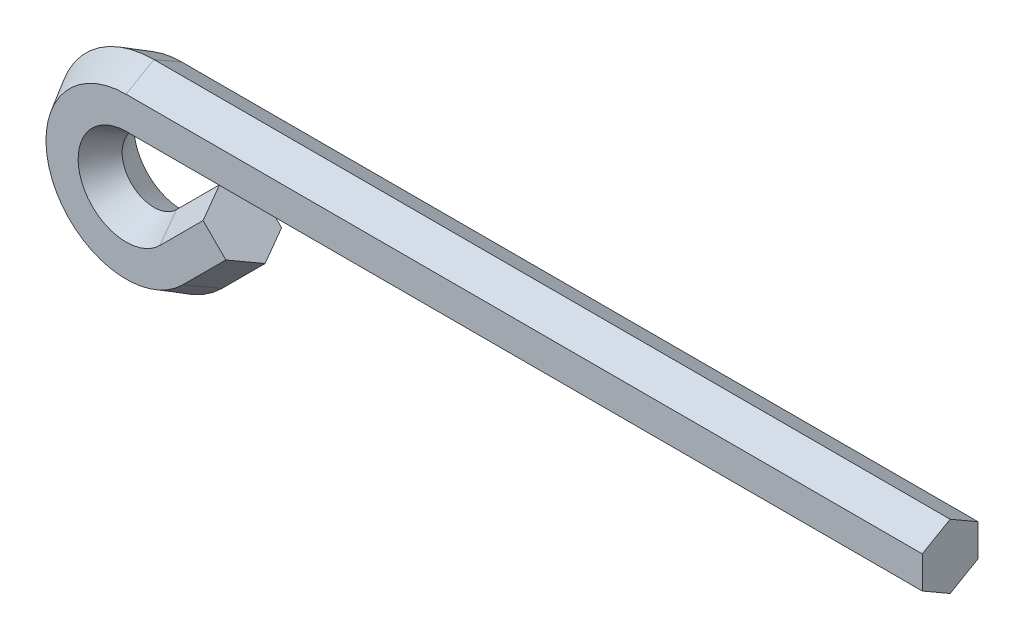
ISO-10303-21;
HEADER;
FILE_DESCRIPTION(('STEP AP214'),'2;1');
FILE_NAME('part.step','',(''),(''),'','','');
FILE_SCHEMA(('AUTOMOTIVE_DESIGN { 1 0 10303 214 1 1 1 1 }'));
ENDSEC;
DATA;
#1=APPLICATION_CONTEXT('core data for automotive mechanical design processes');
#2=APPLICATION_PROTOCOL_DEFINITION('international standard','automotive_design',2000,#1);
#3=PRODUCT_CONTEXT('',#1,'mechanical');
#4=PRODUCT('Part','Part','',(#3));
#5=PRODUCT_RELATED_PRODUCT_CATEGORY('part','',(#4));
#6=PRODUCT_DEFINITION_FORMATION('','',#4);
#7=PRODUCT_DEFINITION_CONTEXT('part definition',#1,'design');
#8=PRODUCT_DEFINITION('design','',#6,#7);
#9=PRODUCT_DEFINITION_SHAPE('','',#8);
#10=(LENGTH_UNIT() NAMED_UNIT(*) SI_UNIT(.MILLI.,.METRE.));
#11=(NAMED_UNIT(*) PLANE_ANGLE_UNIT() SI_UNIT($,.RADIAN.));
#12=(NAMED_UNIT(*) SI_UNIT($,.STERADIAN.) SOLID_ANGLE_UNIT());
#13=UNCERTAINTY_MEASURE_WITH_UNIT(LENGTH_MEASURE(1.E-05),#10,'distance_accuracy_value','');
#14=(GEOMETRIC_REPRESENTATION_CONTEXT(3) GLOBAL_UNCERTAINTY_ASSIGNED_CONTEXT((#13)) GLOBAL_UNIT_ASSIGNED_CONTEXT((#10,
#11,#12)) REPRESENTATION_CONTEXT('',''));
#15=CARTESIAN_POINT('',(0.,0.,0.));
#16=DIRECTION('',(0.,0.,1.));
#17=DIRECTION('',(1.,0.,0.));
#18=AXIS2_PLACEMENT_3D('',#15,#16,#17);
#19=CARTESIAN_POINT('',(7.11503417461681,-7.11503417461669,-3.5));
#20=DIRECTION('',(-0.612372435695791,0.612372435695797,0.500000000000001));
#21=DIRECTION('',(-0.707106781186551,-0.707106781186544,0.));
#22=AXIS2_PLACEMENT_3D('',#19,#20,#21);
#23=PLANE('',#22);
#24=DIRECTION('',(0.353553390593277,-0.353553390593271,0.866025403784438));
#25=VECTOR('',#24,1.);
#26=CARTESIAN_POINT('',(7.11503417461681,-7.11503417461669,-3.5));
#27=LINE('',#26,#25);
#28=CARTESIAN_POINT('',(7.11503417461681,-7.11503417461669,-3.5));
#29=VERTEX_POINT('',#28);
#30=CARTESIAN_POINT('',(8.54390319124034,-8.5439031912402,0.));
#31=VERTEX_POINT('',#30);
#32=EDGE_CURVE('E133',#29,#31,#27,.T.);
#33=ORIENTED_EDGE('',*,*,#32,.F.);
#34=DIRECTION('',(0.707106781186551,0.707106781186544,0.));
#35=VECTOR('',#34,1.);
#36=CARTESIAN_POINT('',(7.11503417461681,-7.11503417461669,-3.5));
#37=LINE('',#36,#35);
#38=CARTESIAN_POINT('',(12.52924773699,-1.70082061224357,-3.5));
#39=VERTEX_POINT('',#38);
#40=EDGE_CURVE('E42',#29,#39,#37,.T.);
#41=ORIENTED_EDGE('',*,*,#40,.T.);
#42=DIRECTION('',(0.353553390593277,-0.353553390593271,0.866025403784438));
#43=VECTOR('',#42,1.);
#44=CARTESIAN_POINT('',(12.52924773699,-1.70082061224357,-3.5));
#45=LINE('',#44,#43);
#46=CARTESIAN_POINT('',(13.9581167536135,-3.12968962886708,0.));
#47=VERTEX_POINT('',#46);
#48=EDGE_CURVE('E49',#39,#47,#45,.T.);
#49=ORIENTED_EDGE('',*,*,#48,.T.);
#50=DIRECTION('',(0.707106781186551,0.707106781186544,0.));
#51=VECTOR('',#50,1.);
#52=CARTESIAN_POINT('',(8.54390319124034,-8.5439031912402,0.));
#53=LINE('',#52,#51);
#54=EDGE_CURVE('E11',#31,#47,#53,.T.);
#55=ORIENTED_EDGE('',*,*,#54,.F.);
#56=EDGE_LOOP('',(#33,#41,#49,#55));
#57=FACE_BOUND('',#56,.T.);
#58=ADVANCED_FACE('F34',(#57),#23,.F.);
#59=CARTESIAN_POINT('',(2.82842712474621,-2.82842712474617,0.));
#60=DIRECTION('',(0.612372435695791,-0.612372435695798,0.5));
#61=DIRECTION('',(0.707106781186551,0.707106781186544,0.));
#62=AXIS2_PLACEMENT_3D('',#59,#60,#61);
#63=PLANE('',#62);
#64=DIRECTION('',(0.353553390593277,-0.353553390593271,-0.866025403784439));
#65=VECTOR('',#64,1.);
#66=CARTESIAN_POINT('',(2.82842712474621,-2.82842712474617,0.));
#67=LINE('',#66,#65);
#68=CARTESIAN_POINT('',(2.82842712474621,-2.82842712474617,0.));
#69=VERTEX_POINT('',#68);
#70=CARTESIAN_POINT('',(4.25729614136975,-4.25729614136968,-3.5));
#71=VERTEX_POINT('',#70);
#72=EDGE_CURVE('E212',#69,#71,#67,.T.);
#73=ORIENTED_EDGE('',*,*,#72,.F.);
#74=DIRECTION('',(0.707106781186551,0.707106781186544,0.));
#75=VECTOR('',#74,1.);
#76=CARTESIAN_POINT('',(2.82842712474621,-2.82842712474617,0.));
#77=LINE('',#76,#75);
#78=CARTESIAN_POINT('',(8.24264068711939,2.58578643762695,0.));
#79=VERTEX_POINT('',#78);
#80=EDGE_CURVE('E256',#69,#79,#77,.T.);
#81=ORIENTED_EDGE('',*,*,#80,.T.);
#82=DIRECTION('',(0.353553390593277,-0.353553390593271,-0.866025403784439));
#83=VECTOR('',#82,1.);
#84=CARTESIAN_POINT('',(8.24264068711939,2.58578643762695,0.));
#85=LINE('',#84,#83);
#86=CARTESIAN_POINT('',(9.67150970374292,1.15691742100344,-3.5));
#87=VERTEX_POINT('',#86);
#88=EDGE_CURVE('E243',#79,#87,#85,.T.);
#89=ORIENTED_EDGE('',*,*,#88,.T.);
#90=DIRECTION('',(0.707106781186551,0.707106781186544,0.));
#91=VECTOR('',#90,1.);
#92=CARTESIAN_POINT('',(4.25729614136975,-4.25729614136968,-3.5));
#93=LINE('',#92,#91);
#94=EDGE_CURVE('E260',#71,#87,#93,.T.);
#95=ORIENTED_EDGE('',*,*,#94,.F.);
#96=EDGE_LOOP('',(#73,#81,#89,#95));
#97=FACE_BOUND('',#96,.T.);
#98=ADVANCED_FACE('F282',(#97),#63,.F.);
#99=CARTESIAN_POINT('',(2.82842712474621,-2.82842712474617,0.));
#100=DIRECTION('',(-0.612372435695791,0.612372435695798,0.5));
#101=DIRECTION('',(-0.707106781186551,-0.707106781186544,0.));
#102=AXIS2_PLACEMENT_3D('',#99,#100,#101);
#103=PLANE('',#102);
#104=DIRECTION('',(0.353553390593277,-0.353553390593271,0.866025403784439));
#105=VECTOR('',#104,1.);
#106=CARTESIAN_POINT('',(2.82842712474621,-2.82842712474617,0.));
#107=LINE('',#106,#105);
#108=CARTESIAN_POINT('',(4.25729614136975,-4.25729614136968,3.5));
#109=VERTEX_POINT('',#108);
#110=EDGE_CURVE('E209',#69,#109,#107,.T.);
#111=ORIENTED_EDGE('',*,*,#110,.T.);
#112=DIRECTION('',(0.707106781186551,0.707106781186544,0.));
#113=VECTOR('',#112,1.);
#114=CARTESIAN_POINT('',(4.25729614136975,-4.25729614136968,3.5));
#115=LINE('',#114,#113);
#116=CARTESIAN_POINT('',(9.67150970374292,1.15691742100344,3.5));
#117=VERTEX_POINT('',#116);
#118=EDGE_CURVE('E252',#109,#117,#115,.T.);
#119=ORIENTED_EDGE('',*,*,#118,.T.);
#120=DIRECTION('',(0.353553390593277,-0.353553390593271,0.866025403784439));
#121=VECTOR('',#120,1.);
#122=CARTESIAN_POINT('',(8.24264068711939,2.58578643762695,0.));
#123=LINE('',#122,#121);
#124=EDGE_CURVE('E240',#79,#117,#123,.T.);
#125=ORIENTED_EDGE('',*,*,#124,.F.);
#126=ORIENTED_EDGE('',*,*,#80,.F.);
#127=EDGE_LOOP('',(#111,#119,#125,#126));
#128=FACE_BOUND('',#127,.T.);
#129=ADVANCED_FACE('F286',(#128),#103,.T.);
#130=CARTESIAN_POINT('',(7.11503417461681,-7.11503417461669,3.5));
#131=DIRECTION('',(0.612372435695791,-0.612372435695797,0.500000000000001));
#132=DIRECTION('',(0.707106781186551,0.707106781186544,0.));
#133=AXIS2_PLACEMENT_3D('',#130,#131,#132);
#134=PLANE('',#133);
#135=DIRECTION('',(0.353553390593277,-0.353553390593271,-0.866025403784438));
#136=VECTOR('',#135,1.);
#137=CARTESIAN_POINT('',(7.11503417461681,-7.11503417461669,3.5));
#138=LINE('',#137,#136);
#139=CARTESIAN_POINT('',(7.11503417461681,-7.11503417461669,3.5));
#140=VERTEX_POINT('',#139);
#141=EDGE_CURVE('E160',#140,#31,#138,.T.);
#142=ORIENTED_EDGE('',*,*,#141,.T.);
#143=ORIENTED_EDGE('',*,*,#54,.T.);
#144=DIRECTION('',(0.353553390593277,-0.353553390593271,-0.866025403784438));
#145=VECTOR('',#144,1.);
#146=CARTESIAN_POINT('',(12.52924773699,-1.70082061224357,3.5));
#147=LINE('',#146,#145);
#148=CARTESIAN_POINT('',(12.52924773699,-1.70082061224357,3.5));
#149=VERTEX_POINT('',#148);
#150=EDGE_CURVE('E137',#149,#47,#147,.T.);
#151=ORIENTED_EDGE('',*,*,#150,.F.);
#152=DIRECTION('',(0.707106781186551,0.707106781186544,0.));
#153=VECTOR('',#152,1.);
#154=CARTESIAN_POINT('',(7.11503417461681,-7.11503417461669,3.5));
#155=LINE('',#154,#153);
#156=EDGE_CURVE('E249',#140,#149,#155,.T.);
#157=ORIENTED_EDGE('',*,*,#156,.F.);
#158=EDGE_LOOP('',(#142,#143,#151,#157));
#159=FACE_BOUND('',#158,.T.);
#160=ADVANCED_FACE('F291',(#159),#134,.T.);
#161=CARTESIAN_POINT('',(0.,0.,-3.5));
#162=DIRECTION('',(0.,0.,1.));
#163=DIRECTION('',(1.,0.,0.));
#164=AXIS2_PLACEMENT_3D('',#161,#162,#163);
#165=CONICAL_SURFACE('',#164,10.0621778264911,0.523598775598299);
#166=DIRECTION('',(0.,0.500000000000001,0.866025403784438));
#167=VECTOR('',#166,1.);
#168=CARTESIAN_POINT('',(0.,10.0621778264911,-3.5));
#169=LINE('',#168,#167);
#170=CARTESIAN_POINT('',(0.,10.0621778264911,-3.5));
#171=VERTEX_POINT('',#170);
#172=CARTESIAN_POINT('',(0.,12.0829037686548,0.));
#173=VERTEX_POINT('',#172);
#174=EDGE_CURVE('E130',#171,#173,#169,.T.);
#175=ORIENTED_EDGE('',*,*,#174,.F.);
#176=CARTESIAN_POINT('',(0.,0.,-3.5));
#177=DIRECTION('',(0.,0.,1.));
#178=DIRECTION('',(1.,0.,0.));
#179=AXIS2_PLACEMENT_3D('',#176,#177,#178);
#180=CIRCLE('',#179,10.0621778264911);
#181=EDGE_CURVE('E138',#171,#29,#180,.T.);
#182=ORIENTED_EDGE('',*,*,#181,.T.);
#183=ORIENTED_EDGE('',*,*,#32,.T.);
#184=CARTESIAN_POINT('',(0.,0.,0.));
#185=DIRECTION('',(0.,0.,1.));
#186=DIRECTION('',(1.,0.,0.));
#187=AXIS2_PLACEMENT_3D('',#184,#185,#186);
#188=CIRCLE('',#187,12.0829037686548);
#189=EDGE_CURVE('E125',#173,#31,#188,.T.);
#190=ORIENTED_EDGE('',*,*,#189,.F.);
#191=EDGE_LOOP('',(#175,#182,#183,#190));
#192=FACE_BOUND('',#191,.T.);
#193=ADVANCED_FACE('F127',(#192),#165,.T.);
#194=CARTESIAN_POINT('',(0.,0.,0.));
#195=DIRECTION('',(0.,0.,-1.));
#196=DIRECTION('',(-1.,0.,0.));
#197=AXIS2_PLACEMENT_3D('',#194,#195,#196);
#198=CONICAL_SURFACE('',#197,4.,0.523598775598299);
#199=DIRECTION('',(0.,0.5,-0.866025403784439));
#200=VECTOR('',#199,1.);
#201=CARTESIAN_POINT('',(0.,4.,0.));
#202=LINE('',#201,#200);
#203=CARTESIAN_POINT('',(0.,4.,0.));
#204=VERTEX_POINT('',#203);
#205=CARTESIAN_POINT('',(0.,6.02072594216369,-3.5));
#206=VERTEX_POINT('',#205);
#207=EDGE_CURVE('E165',#204,#206,#202,.T.);
#208=ORIENTED_EDGE('',*,*,#207,.F.);
#209=CARTESIAN_POINT('',(0.,0.,0.));
#210=DIRECTION('',(0.,0.,1.));
#211=DIRECTION('',(1.,0.,0.));
#212=AXIS2_PLACEMENT_3D('',#209,#210,#211);
#213=CIRCLE('',#212,4.);
#214=EDGE_CURVE('E224',#204,#69,#213,.T.);
#215=ORIENTED_EDGE('',*,*,#214,.T.);
#216=ORIENTED_EDGE('',*,*,#72,.T.);
#217=CARTESIAN_POINT('',(0.,0.,-3.5));
#218=DIRECTION('',(0.,0.,1.));
#219=DIRECTION('',(1.,0.,0.));
#220=AXIS2_PLACEMENT_3D('',#217,#218,#219);
#221=CIRCLE('',#220,6.02072594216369);
#222=EDGE_CURVE('E228',#206,#71,#221,.T.);
#223=ORIENTED_EDGE('',*,*,#222,.F.);
#224=EDGE_LOOP('',(#208,#215,#216,#223));
#225=FACE_BOUND('',#224,.T.);
#226=ADVANCED_FACE('F278',(#225),#198,.F.);
#227=CARTESIAN_POINT('',(0.,0.,0.));
#228=DIRECTION('',(0.,0.,1.));
#229=DIRECTION('',(1.,0.,0.));
#230=AXIS2_PLACEMENT_3D('',#227,#228,#229);
#231=CONICAL_SURFACE('',#230,4.,0.523598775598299);
#232=DIRECTION('',(0.,0.5,0.866025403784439));
#233=VECTOR('',#232,1.);
#234=CARTESIAN_POINT('',(0.,4.,0.));
#235=LINE('',#234,#233);
#236=CARTESIAN_POINT('',(0.,6.02072594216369,3.5));
#237=VERTEX_POINT('',#236);
#238=EDGE_CURVE('E172',#204,#237,#235,.T.);
#239=ORIENTED_EDGE('',*,*,#238,.T.);
#240=CARTESIAN_POINT('',(0.,0.,3.5));
#241=DIRECTION('',(0.,0.,1.));
#242=DIRECTION('',(1.,0.,0.));
#243=AXIS2_PLACEMENT_3D('',#240,#241,#242);
#244=CIRCLE('',#243,6.02072594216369);
#245=EDGE_CURVE('E220',#237,#109,#244,.T.);
#246=ORIENTED_EDGE('',*,*,#245,.T.);
#247=ORIENTED_EDGE('',*,*,#110,.F.);
#248=ORIENTED_EDGE('',*,*,#214,.F.);
#249=EDGE_LOOP('',(#239,#246,#247,#248));
#250=FACE_BOUND('',#249,.T.);
#251=ADVANCED_FACE('F284',(#250),#231,.F.);
#252=CARTESIAN_POINT('',(0.,0.,3.5));
#253=DIRECTION('',(0.,0.,-1.));
#254=DIRECTION('',(-1.,0.,0.));
#255=AXIS2_PLACEMENT_3D('',#252,#253,#254);
#256=CONICAL_SURFACE('',#255,10.0621778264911,0.523598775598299);
#257=DIRECTION('',(0.,0.500000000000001,-0.866025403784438));
#258=VECTOR('',#257,1.);
#259=CARTESIAN_POINT('',(0.,10.0621778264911,3.5));
#260=LINE('',#259,#258);
#261=CARTESIAN_POINT('',(0.,10.0621778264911,3.5));
#262=VERTEX_POINT('',#261);
#263=EDGE_CURVE('E141',#262,#173,#260,.T.);
#264=ORIENTED_EDGE('',*,*,#263,.T.);
#265=ORIENTED_EDGE('',*,*,#189,.T.);
#266=ORIENTED_EDGE('',*,*,#141,.F.);
#267=CARTESIAN_POINT('',(0.,0.,3.5));
#268=DIRECTION('',(0.,0.,1.));
#269=DIRECTION('',(1.,0.,0.));
#270=AXIS2_PLACEMENT_3D('',#267,#268,#269);
#271=CIRCLE('',#270,10.0621778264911);
#272=EDGE_CURVE('E145',#262,#140,#271,.T.);
#273=ORIENTED_EDGE('',*,*,#272,.F.);
#274=EDGE_LOOP('',(#264,#265,#266,#273));
#275=FACE_BOUND('',#274,.T.);
#276=ADVANCED_FACE('F143',(#275),#256,.T.);
#277=CARTESIAN_POINT('',(0.,10.0621778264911,3.5));
#278=DIRECTION('',(0.,-0.866025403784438,-0.500000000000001));
#279=DIRECTION('',(0.,0.500000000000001,-0.866025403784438));
#280=AXIS2_PLACEMENT_3D('',#277,#278,#279);
#281=PLANE('',#280);
#282=DIRECTION('',(0.,0.500000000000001,-0.866025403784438));
#283=VECTOR('',#282,1.);
#284=CARTESIAN_POINT('',(100.,10.0621778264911,3.5));
#285=LINE('',#284,#283);
#286=CARTESIAN_POINT('',(100.,10.0621778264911,3.5));
#287=VERTEX_POINT('',#286);
#288=CARTESIAN_POINT('',(100.,12.0829037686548,0.));
#289=VERTEX_POINT('',#288);
#290=EDGE_CURVE('E155',#287,#289,#285,.T.);
#291=ORIENTED_EDGE('',*,*,#290,.T.);
#292=DIRECTION('',(1.,0.,0.));
#293=VECTOR('',#292,1.);
#294=CARTESIAN_POINT('',(0.,12.0829037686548,0.));
#295=LINE('',#294,#293);
#296=EDGE_CURVE('E152',#173,#289,#295,.T.);
#297=ORIENTED_EDGE('',*,*,#296,.F.);
#298=ORIENTED_EDGE('',*,*,#263,.F.);
#299=DIRECTION('',(1.,0.,0.));
#300=VECTOR('',#299,1.);
#301=CARTESIAN_POINT('',(0.,10.0621778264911,3.5));
#302=LINE('',#301,#300);
#303=EDGE_CURVE('E178',#262,#287,#302,.T.);
#304=ORIENTED_EDGE('',*,*,#303,.T.);
#305=EDGE_LOOP('',(#291,#297,#298,#304));
#306=FACE_BOUND('',#305,.T.);
#307=ADVANCED_FACE('F153',(#306),#281,.F.);
#308=CARTESIAN_POINT('',(0.,10.0621778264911,-3.5));
#309=DIRECTION('',(0.,0.866025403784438,-0.500000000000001));
#310=DIRECTION('',(0.,0.500000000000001,0.866025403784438));
#311=AXIS2_PLACEMENT_3D('',#308,#309,#310);
#312=PLANE('',#311);
#313=DIRECTION('',(0.,0.500000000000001,0.866025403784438));
#314=VECTOR('',#313,1.);
#315=CARTESIAN_POINT('',(100.,10.0621778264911,-3.5));
#316=LINE('',#315,#314);
#317=CARTESIAN_POINT('',(100.,10.0621778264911,-3.5));
#318=VERTEX_POINT('',#317);
#319=EDGE_CURVE('E180',#318,#289,#316,.T.);
#320=ORIENTED_EDGE('',*,*,#319,.F.);
#321=DIRECTION('',(1.,0.,0.));
#322=VECTOR('',#321,1.);
#323=CARTESIAN_POINT('',(0.,10.0621778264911,-3.5));
#324=LINE('',#323,#322);
#325=EDGE_CURVE('E161',#171,#318,#324,.T.);
#326=ORIENTED_EDGE('',*,*,#325,.F.);
#327=ORIENTED_EDGE('',*,*,#174,.T.);
#328=ORIENTED_EDGE('',*,*,#296,.T.);
#329=EDGE_LOOP('',(#320,#326,#327,#328));
#330=FACE_BOUND('',#329,.T.);
#331=ADVANCED_FACE('F163',(#330),#312,.T.);
#332=CARTESIAN_POINT('',(0.,6.02072594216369,-3.5));
#333=DIRECTION('',(0.,0.,-1.));
#334=DIRECTION('',(-1.,0.,0.));
#335=AXIS2_PLACEMENT_3D('',#332,#333,#334);
#336=PLANE('',#335);
#337=DIRECTION('',(0.,1.,0.));
#338=VECTOR('',#337,1.);
#339=CARTESIAN_POINT('',(100.,6.0207259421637,-3.5));
#340=LINE('',#339,#338);
#341=CARTESIAN_POINT('',(100.,6.0207259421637,-3.5));
#342=VERTEX_POINT('',#341);
#343=EDGE_CURVE('E183',#342,#318,#340,.T.);
#344=ORIENTED_EDGE('',*,*,#343,.F.);
#345=DIRECTION('',(1.,0.,0.));
#346=VECTOR('',#345,1.);
#347=CARTESIAN_POINT('',(0.,6.02072594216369,-3.5));
#348=LINE('',#347,#346);
#349=EDGE_CURVE('E201',#206,#342,#348,.T.);
#350=ORIENTED_EDGE('',*,*,#349,.F.);
#351=ORIENTED_EDGE('',*,*,#222,.T.);
#352=ORIENTED_EDGE('',*,*,#94,.T.);
#353=DIRECTION('',(0.707106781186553,-0.707106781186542,0.));
#354=VECTOR('',#353,1.);
#355=CARTESIAN_POINT('',(9.67150970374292,1.15691742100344,-3.5));
#356=LINE('',#355,#354);
#357=EDGE_CURVE('E57',#87,#39,#356,.T.);
#358=ORIENTED_EDGE('',*,*,#357,.T.);
#359=ORIENTED_EDGE('',*,*,#40,.F.);
#360=ORIENTED_EDGE('',*,*,#181,.F.);
#361=ORIENTED_EDGE('',*,*,#325,.T.);
#362=EDGE_LOOP('',(#344,#350,#351,#352,#358,#359,#360,#361));
#363=FACE_BOUND('',#362,.T.);
#364=ADVANCED_FACE('F265',(#363),#336,.T.);
#365=CARTESIAN_POINT('',(0.,4.,0.));
#366=DIRECTION('',(0.,-0.866025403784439,-0.5));
#367=DIRECTION('',(0.,0.5,-0.866025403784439));
#368=AXIS2_PLACEMENT_3D('',#365,#366,#367);
#369=PLANE('',#368);
#370=DIRECTION('',(0.,0.5,-0.866025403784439));
#371=VECTOR('',#370,1.);
#372=CARTESIAN_POINT('',(100.,4.00000000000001,0.));
#373=LINE('',#372,#371);
#374=CARTESIAN_POINT('',(100.,4.00000000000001,0.));
#375=VERTEX_POINT('',#374);
#376=EDGE_CURVE('E186',#375,#342,#373,.T.);
#377=ORIENTED_EDGE('',*,*,#376,.F.);
#378=DIRECTION('',(1.,0.,0.));
#379=VECTOR('',#378,1.);
#380=CARTESIAN_POINT('',(0.,4.,0.));
#381=LINE('',#380,#379);
#382=EDGE_CURVE('E199',#204,#375,#381,.T.);
#383=ORIENTED_EDGE('',*,*,#382,.F.);
#384=ORIENTED_EDGE('',*,*,#207,.T.);
#385=ORIENTED_EDGE('',*,*,#349,.T.);
#386=EDGE_LOOP('',(#377,#383,#384,#385));
#387=FACE_BOUND('',#386,.T.);
#388=ADVANCED_FACE('F274',(#387),#369,.T.);
#389=CARTESIAN_POINT('',(0.,4.,0.));
#390=DIRECTION('',(0.,0.866025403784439,-0.5));
#391=DIRECTION('',(0.,0.5,0.866025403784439));
#392=AXIS2_PLACEMENT_3D('',#389,#390,#391);
#393=PLANE('',#392);
#394=DIRECTION('',(0.,0.5,0.866025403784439));
#395=VECTOR('',#394,1.);
#396=CARTESIAN_POINT('',(100.,4.00000000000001,0.));
#397=LINE('',#396,#395);
#398=CARTESIAN_POINT('',(100.,6.0207259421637,3.5));
#399=VERTEX_POINT('',#398);
#400=EDGE_CURVE('E189',#375,#399,#397,.T.);
#401=ORIENTED_EDGE('',*,*,#400,.T.);
#402=DIRECTION('',(1.,0.,0.));
#403=VECTOR('',#402,1.);
#404=CARTESIAN_POINT('',(0.,6.02072594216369,3.5));
#405=LINE('',#404,#403);
#406=EDGE_CURVE('E195',#237,#399,#405,.T.);
#407=ORIENTED_EDGE('',*,*,#406,.F.);
#408=ORIENTED_EDGE('',*,*,#238,.F.);
#409=ORIENTED_EDGE('',*,*,#382,.T.);
#410=EDGE_LOOP('',(#401,#407,#408,#409));
#411=FACE_BOUND('',#410,.T.);
#412=ADVANCED_FACE('F296',(#411),#393,.F.);
#413=CARTESIAN_POINT('',(0.,6.02072594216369,3.5));
#414=DIRECTION('',(0.,0.,-1.));
#415=DIRECTION('',(-1.,0.,0.));
#416=AXIS2_PLACEMENT_3D('',#413,#414,#415);
#417=PLANE('',#416);
#418=DIRECTION('',(0.,1.,0.));
#419=VECTOR('',#418,1.);
#420=CARTESIAN_POINT('',(100.,6.0207259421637,3.5));
#421=LINE('',#420,#419);
#422=EDGE_CURVE('E149',#399,#287,#421,.T.);
#423=ORIENTED_EDGE('',*,*,#422,.T.);
#424=ORIENTED_EDGE('',*,*,#303,.F.);
#425=ORIENTED_EDGE('',*,*,#272,.T.);
#426=ORIENTED_EDGE('',*,*,#156,.T.);
#427=DIRECTION('',(0.707106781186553,-0.707106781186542,0.));
#428=VECTOR('',#427,1.);
#429=CARTESIAN_POINT('',(9.67150970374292,1.15691742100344,3.5));
#430=LINE('',#429,#428);
#431=EDGE_CURVE('E236',#117,#149,#430,.T.);
#432=ORIENTED_EDGE('',*,*,#431,.F.);
#433=ORIENTED_EDGE('',*,*,#118,.F.);
#434=ORIENTED_EDGE('',*,*,#245,.F.);
#435=ORIENTED_EDGE('',*,*,#406,.T.);
#436=EDGE_LOOP('',(#423,#424,#425,#426,#432,#433,#434,#435));
#437=FACE_BOUND('',#436,.T.);
#438=ADVANCED_FACE('F293',(#437),#417,.F.);
#439=CARTESIAN_POINT('',(13.9581167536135,-3.12968962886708,0.));
#440=DIRECTION('',(-0.707106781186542,-0.707106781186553,0.));
#441=DIRECTION('',(0.,0.,-1.));
#442=AXIS2_PLACEMENT_3D('',#439,#440,#441);
#443=PLANE('',#442);
#444=ORIENTED_EDGE('',*,*,#150,.T.);
#445=ORIENTED_EDGE('',*,*,#48,.F.);
#446=ORIENTED_EDGE('',*,*,#357,.F.);
#447=ORIENTED_EDGE('',*,*,#88,.F.);
#448=ORIENTED_EDGE('',*,*,#124,.T.);
#449=ORIENTED_EDGE('',*,*,#431,.T.);
#450=EDGE_LOOP('',(#444,#445,#446,#447,#448,#449));
#451=FACE_BOUND('',#450,.T.);
#452=ADVANCED_FACE('F289',(#451),#443,.F.);
#453=CARTESIAN_POINT('',(100.,12.0829037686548,0.));
#454=DIRECTION('',(1.,0.,0.));
#455=DIRECTION('',(0.,0.,-1.));
#456=AXIS2_PLACEMENT_3D('',#453,#454,#455);
#457=PLANE('',#456);
#458=ORIENTED_EDGE('',*,*,#290,.F.);
#459=ORIENTED_EDGE('',*,*,#422,.F.);
#460=ORIENTED_EDGE('',*,*,#400,.F.);
#461=ORIENTED_EDGE('',*,*,#376,.T.);
#462=ORIENTED_EDGE('',*,*,#343,.T.);
#463=ORIENTED_EDGE('',*,*,#319,.T.);
#464=EDGE_LOOP('',(#458,#459,#460,#461,#462,#463));
#465=FACE_BOUND('',#464,.T.);
#466=ADVANCED_FACE('F268',(#465),#457,.T.);
#467=CLOSED_SHELL('',(#58,#98,#129,#160,#193,#226,#251,#276,#307,#331,#364,#388,#412,#438,#452,#466));
#468=MANIFOLD_SOLID_BREP('B2',#467);
#469=ADVANCED_BREP_SHAPE_REPRESENTATION('',(#18,#468),#14);
#470=SHAPE_DEFINITION_REPRESENTATION(#9,#469);
ENDSEC;
END-ISO-10303-21;
